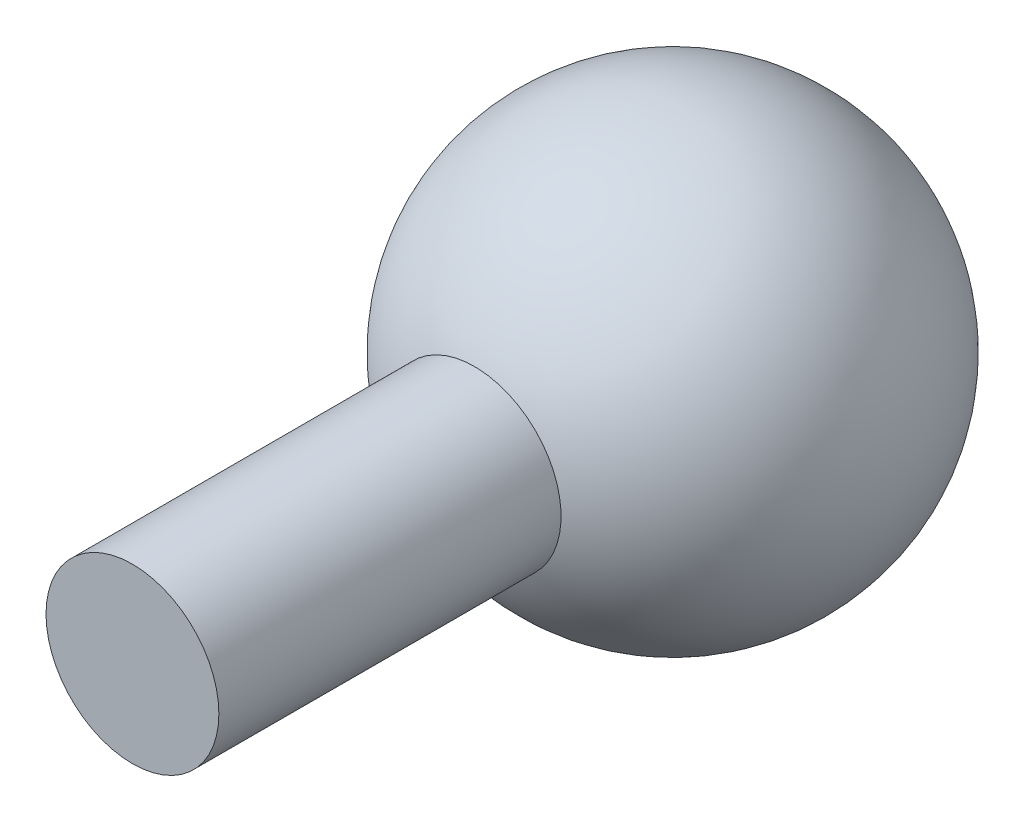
ISO-10303-21;
HEADER;
FILE_DESCRIPTION(('STEP AP214'),'2;1');
FILE_NAME('part.step','',(''),(''),'','','');
FILE_SCHEMA(('AUTOMOTIVE_DESIGN { 1 0 10303 214 1 1 1 1 }'));
ENDSEC;
DATA;
#1=APPLICATION_CONTEXT('core data for automotive mechanical design processes');
#2=APPLICATION_PROTOCOL_DEFINITION('international standard','automotive_design',2000,#1);
#3=PRODUCT_CONTEXT('',#1,'mechanical');
#4=PRODUCT('Part','Part','',(#3));
#5=PRODUCT_RELATED_PRODUCT_CATEGORY('part','',(#4));
#6=PRODUCT_DEFINITION_FORMATION('','',#4);
#7=PRODUCT_DEFINITION_CONTEXT('part definition',#1,'design');
#8=PRODUCT_DEFINITION('design','',#6,#7);
#9=PRODUCT_DEFINITION_SHAPE('','',#8);
#10=(LENGTH_UNIT() NAMED_UNIT(*) SI_UNIT(.MILLI.,.METRE.));
#11=(NAMED_UNIT(*) PLANE_ANGLE_UNIT() SI_UNIT($,.RADIAN.));
#12=(NAMED_UNIT(*) SI_UNIT($,.STERADIAN.) SOLID_ANGLE_UNIT());
#13=UNCERTAINTY_MEASURE_WITH_UNIT(LENGTH_MEASURE(1.E-05),#10,'distance_accuracy_value','');
#14=(GEOMETRIC_REPRESENTATION_CONTEXT(3) GLOBAL_UNCERTAINTY_ASSIGNED_CONTEXT((#13)) GLOBAL_UNIT_ASSIGNED_CONTEXT((#10,
#11,#12)) REPRESENTATION_CONTEXT('',''));
#15=CARTESIAN_POINT('',(0.,0.,0.));
#16=DIRECTION('',(0.,0.,1.));
#17=DIRECTION('',(1.,0.,0.));
#18=AXIS2_PLACEMENT_3D('',#15,#16,#17);
#19=CARTESIAN_POINT('',(0.,0.,25.));
#20=DIRECTION('',(0.,0.,-1.));
#21=DIRECTION('',(-1.,0.,0.));
#22=AXIS2_PLACEMENT_3D('',#19,#20,#21);
#23=CYLINDRICAL_SURFACE('',#22,4.);
#24=CARTESIAN_POINT('',(0.,0.,9.16515138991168));
#25=DIRECTION('',(0.,0.,-1.));
#26=DIRECTION('',(-1.,0.,0.));
#27=AXIS2_PLACEMENT_3D('',#24,#25,#26);
#28=CIRCLE('',#27,4.);
#29=CARTESIAN_POINT('',(-4.,0.,9.16515138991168));
#30=VERTEX_POINT('',#29);
#31=EDGE_CURVE('E10',#30,#30,#28,.T.);
#32=ORIENTED_EDGE('',*,*,#31,.F.);
#33=EDGE_LOOP('',(#32));
#34=FACE_BOUND('',#33,.T.);
#35=CARTESIAN_POINT('',(0.,0.,25.));
#36=DIRECTION('',(0.,0.,1.));
#37=DIRECTION('',(1.,0.,0.));
#38=AXIS2_PLACEMENT_3D('',#35,#36,#37);
#39=CIRCLE('',#38,4.);
#40=CARTESIAN_POINT('',(4.,0.,25.));
#41=VERTEX_POINT('',#40);
#42=EDGE_CURVE('E41',#41,#41,#39,.T.);
#43=ORIENTED_EDGE('',*,*,#42,.F.);
#44=EDGE_LOOP('',(#43));
#45=FACE_BOUND('',#44,.T.);
#46=ADVANCED_FACE('F34',(#34,#45),#23,.T.);
#47=CARTESIAN_POINT('',(0.,0.,25.));
#48=DIRECTION('',(0.,0.,1.));
#49=DIRECTION('',(1.,0.,0.));
#50=AXIS2_PLACEMENT_3D('',#47,#48,#49);
#51=PLANE('',#50);
#52=ORIENTED_EDGE('',*,*,#42,.T.);
#53=EDGE_LOOP('',(#52));
#54=FACE_BOUND('',#53,.T.);
#55=ADVANCED_FACE('F47',(#54),#51,.T.);
#56=CARTESIAN_POINT('',(0.,0.,0.));
#57=DIRECTION('',(0.,1.,0.));
#58=DIRECTION('',(1.,0.,0.));
#59=AXIS2_PLACEMENT_3D('',#56,#57,#58);
#60=SPHERICAL_SURFACE('',#59,10.);
#61=CARTESIAN_POINT('',(0.,0.,0.));
#62=DIRECTION('',(0.,0.,-1.));
#63=DIRECTION('',(-1.,0.,0.));
#64=AXIS2_PLACEMENT_3D('',#61,#62,#63);
#65=SPHERICAL_SURFACE('',#64,10.);
#66=ORIENTED_EDGE('',*,*,#31,.T.);
#67=EDGE_LOOP('',(#66));
#68=FACE_BOUND('',#67,.T.);
#69=ADVANCED_FACE('F36',(#68),#65,.T.);
#70=CLOSED_SHELL('',(#46,#55,#69));
#71=MANIFOLD_SOLID_BREP('B2',#70);
#72=ADVANCED_BREP_SHAPE_REPRESENTATION('',(#18,#71),#14);
#73=SHAPE_DEFINITION_REPRESENTATION(#9,#72);
ENDSEC;
END-ISO-10303-21;
